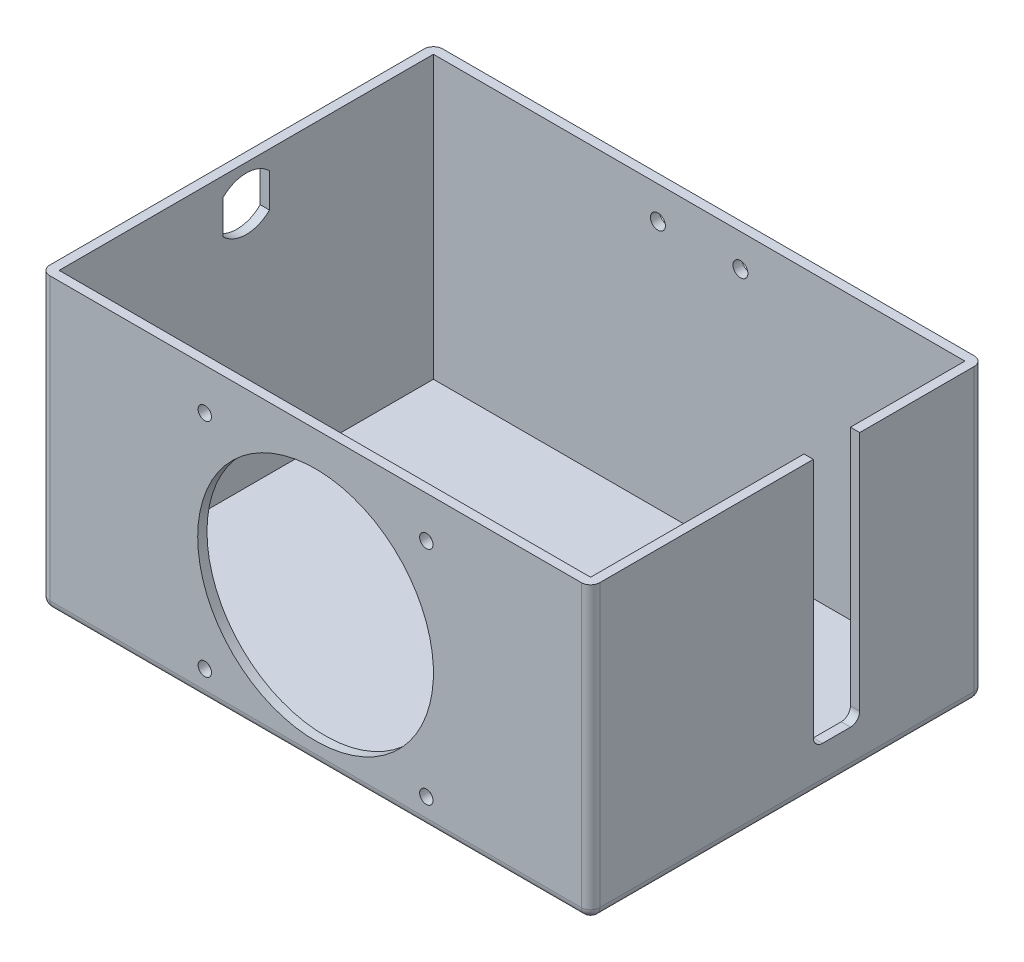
ISO-10303-21;
HEADER;
FILE_DESCRIPTION(('STEP AP214'),'2;1');
FILE_NAME('part.step','',(''),(''),'','','');
FILE_SCHEMA(('AUTOMOTIVE_DESIGN { 1 0 10303 214 1 1 1 1 }'));
ENDSEC;
DATA;
#1=APPLICATION_CONTEXT('core data for automotive mechanical design processes');
#2=APPLICATION_PROTOCOL_DEFINITION('international standard','automotive_design',2000,#1);
#3=PRODUCT_CONTEXT('',#1,'mechanical');
#4=PRODUCT('Part','Part','',(#3));
#5=PRODUCT_RELATED_PRODUCT_CATEGORY('part','',(#4));
#6=PRODUCT_DEFINITION_FORMATION('','',#4);
#7=PRODUCT_DEFINITION_CONTEXT('part definition',#1,'design');
#8=PRODUCT_DEFINITION('design','',#6,#7);
#9=PRODUCT_DEFINITION_SHAPE('','',#8);
#10=(LENGTH_UNIT() NAMED_UNIT(*) SI_UNIT(.MILLI.,.METRE.));
#11=(NAMED_UNIT(*) PLANE_ANGLE_UNIT() SI_UNIT($,.RADIAN.));
#12=(NAMED_UNIT(*) SI_UNIT($,.STERADIAN.) SOLID_ANGLE_UNIT());
#13=UNCERTAINTY_MEASURE_WITH_UNIT(LENGTH_MEASURE(1.E-05),#10,'distance_accuracy_value','');
#14=(GEOMETRIC_REPRESENTATION_CONTEXT(3) GLOBAL_UNCERTAINTY_ASSIGNED_CONTEXT((#13)) GLOBAL_UNIT_ASSIGNED_CONTEXT((#10,
#11,#12)) REPRESENTATION_CONTEXT('',''));
#15=CARTESIAN_POINT('',(0.,0.,0.));
#16=DIRECTION('',(0.,0.,1.));
#17=DIRECTION('',(1.,0.,0.));
#18=AXIS2_PLACEMENT_3D('',#15,#16,#17);
#19=CARTESIAN_POINT('',(88.9,0.,-63.5));
#20=DIRECTION('',(0.,0.,-1.));
#21=DIRECTION('',(-1.,0.,0.));
#22=AXIS2_PLACEMENT_3D('',#19,#20,#21);
#23=PLANE('',#22);
#24=DIRECTION('',(-1.,0.,0.));
#25=VECTOR('',#24,1.);
#26=CARTESIAN_POINT('',(-88.9,3.,-63.5));
#27=LINE('',#26,#25);
#28=CARTESIAN_POINT('',(85.9,3.,-63.5));
#29=VERTEX_POINT('',#28);
#30=CARTESIAN_POINT('',(-85.9,3.,-63.5));
#31=VERTEX_POINT('',#30);
#32=EDGE_CURVE('E405',#29,#31,#27,.T.);
#33=ORIENTED_EDGE('',*,*,#32,.T.);
#34=DIRECTION('',(0.,1.,0.));
#35=VECTOR('',#34,1.);
#36=CARTESIAN_POINT('',(-85.9,0.,-63.5));
#37=LINE('',#36,#35);
#38=CARTESIAN_POINT('',(-85.9,93.98,-63.5));
#39=VERTEX_POINT('',#38);
#40=EDGE_CURVE('E411',#31,#39,#37,.T.);
#41=ORIENTED_EDGE('',*,*,#40,.T.);
#42=DIRECTION('',(-1.,0.,0.));
#43=VECTOR('',#42,1.);
#44=CARTESIAN_POINT('',(88.9,93.98,-63.5));
#45=LINE('',#44,#43);
#46=CARTESIAN_POINT('',(85.9,93.98,-63.5));
#47=VERTEX_POINT('',#46);
#48=EDGE_CURVE('E348',#47,#39,#45,.T.);
#49=ORIENTED_EDGE('',*,*,#48,.F.);
#50=DIRECTION('',(0.,1.,0.));
#51=VECTOR('',#50,1.);
#52=CARTESIAN_POINT('',(85.9,0.,-63.5));
#53=LINE('',#52,#51);
#54=EDGE_CURVE('E408',#47,#29,#53,.F.);
#55=ORIENTED_EDGE('',*,*,#54,.T.);
#56=EDGE_LOOP('',(#33,#41,#49,#55));
#57=FACE_BOUND('',#56,.T.);
#58=CARTESIAN_POINT('',(13.335,83.439,-63.5));
#59=DIRECTION('',(0.,0.,-1.));
#60=DIRECTION('',(-1.,0.,0.));
#61=AXIS2_PLACEMENT_3D('',#58,#59,#60);
#62=CIRCLE('',#61,2.413);
#63=CARTESIAN_POINT('',(10.922,83.439,-63.5));
#64=VERTEX_POINT('',#63);
#65=EDGE_CURVE('E497',#64,#64,#62,.T.);
#66=ORIENTED_EDGE('',*,*,#65,.F.);
#67=EDGE_LOOP('',(#66));
#68=FACE_BOUND('',#67,.T.);
#69=CARTESIAN_POINT('',(-13.335,83.439,-63.5));
#70=DIRECTION('',(0.,0.,1.));
#71=DIRECTION('',(1.,0.,0.));
#72=AXIS2_PLACEMENT_3D('',#69,#70,#71);
#73=CIRCLE('',#72,2.413);
#74=CARTESIAN_POINT('',(-10.922,83.439,-63.5));
#75=VERTEX_POINT('',#74);
#76=EDGE_CURVE('E955',#75,#75,#73,.T.);
#77=ORIENTED_EDGE('',*,*,#76,.T.);
#78=EDGE_LOOP('',(#77));
#79=FACE_BOUND('',#78,.T.);
#80=ADVANCED_FACE('F39',(#57,#68,#79),#23,.T.);
#81=CARTESIAN_POINT('',(85.9,3.,-60.5));
#82=DIRECTION('',(0.,0.,-1.));
#83=DIRECTION('',(-1.,0.,0.));
#84=AXIS2_PLACEMENT_3D('',#81,#82,#83);
#85=PLANE('',#84);
#86=CARTESIAN_POINT('',(13.335,83.439,-60.5));
#87=DIRECTION('',(0.,0.,-1.));
#88=DIRECTION('',(-1.,0.,0.));
#89=AXIS2_PLACEMENT_3D('',#86,#87,#88);
#90=CIRCLE('',#89,2.413);
#91=CARTESIAN_POINT('',(10.922,83.439,-60.5));
#92=VERTEX_POINT('',#91);
#93=EDGE_CURVE('E963',#92,#92,#90,.F.);
#94=ORIENTED_EDGE('',*,*,#93,.F.);
#95=EDGE_LOOP('',(#94));
#96=FACE_BOUND('',#95,.T.);
#97=DIRECTION('',(-1.,0.,0.));
#98=VECTOR('',#97,1.);
#99=CARTESIAN_POINT('',(85.9,93.98,-60.5));
#100=LINE('',#99,#98);
#101=CARTESIAN_POINT('',(85.9,93.98,-60.5));
#102=VERTEX_POINT('',#101);
#103=CARTESIAN_POINT('',(-85.9,93.98,-60.5));
#104=VERTEX_POINT('',#103);
#105=EDGE_CURVE('E295',#102,#104,#100,.T.);
#106=ORIENTED_EDGE('',*,*,#105,.T.);
#107=DIRECTION('',(0.,1.,0.));
#108=VECTOR('',#107,1.);
#109=CARTESIAN_POINT('',(-85.9,3.,-60.5));
#110=LINE('',#109,#108);
#111=CARTESIAN_POINT('',(-85.9,3.,-60.5));
#112=VERTEX_POINT('',#111);
#113=EDGE_CURVE('E322',#112,#104,#110,.T.);
#114=ORIENTED_EDGE('',*,*,#113,.F.);
#115=DIRECTION('',(-1.,0.,0.));
#116=VECTOR('',#115,1.);
#117=CARTESIAN_POINT('',(85.9,3.,-60.5));
#118=LINE('',#117,#116);
#119=CARTESIAN_POINT('',(85.9,3.,-60.5));
#120=VERTEX_POINT('',#119);
#121=EDGE_CURVE('E303',#120,#112,#118,.T.);
#122=ORIENTED_EDGE('',*,*,#121,.F.);
#123=DIRECTION('',(0.,1.,0.));
#124=VECTOR('',#123,1.);
#125=CARTESIAN_POINT('',(85.9,3.,-60.5));
#126=LINE('',#125,#124);
#127=EDGE_CURVE('E326',#120,#102,#126,.T.);
#128=ORIENTED_EDGE('',*,*,#127,.T.);
#129=EDGE_LOOP('',(#106,#114,#122,#128));
#130=FACE_BOUND('',#129,.T.);
#131=CARTESIAN_POINT('',(-13.335,83.439,-60.5));
#132=DIRECTION('',(0.,0.,-1.));
#133=DIRECTION('',(-1.,0.,0.));
#134=AXIS2_PLACEMENT_3D('',#131,#132,#133);
#135=CIRCLE('',#134,2.413);
#136=CARTESIAN_POINT('',(-15.748,83.439,-60.5));
#137=VERTEX_POINT('',#136);
#138=EDGE_CURVE('E439',#137,#137,#135,.T.);
#139=ORIENTED_EDGE('',*,*,#138,.T.);
#140=EDGE_LOOP('',(#139));
#141=FACE_BOUND('',#140,.T.);
#142=ADVANCED_FACE('F549',(#96,#130,#141),#85,.F.);
#143=CARTESIAN_POINT('',(-85.9,3.,60.5));
#144=DIRECTION('',(0.,0.,1.));
#145=DIRECTION('',(1.,0.,0.));
#146=AXIS2_PLACEMENT_3D('',#143,#144,#145);
#147=PLANE('',#146);
#148=CARTESIAN_POINT('',(-35.809,80.604,60.5));
#149=DIRECTION('',(0.,0.,-1.));
#150=DIRECTION('',(-1.,0.,0.));
#151=AXIS2_PLACEMENT_3D('',#148,#149,#150);
#152=CIRCLE('',#151,2.15899999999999);
#153=CARTESIAN_POINT('',(-37.968,80.604,60.5));
#154=VERTEX_POINT('',#153);
#155=EDGE_CURVE('E494',#154,#154,#152,.T.);
#156=ORIENTED_EDGE('',*,*,#155,.F.);
#157=EDGE_LOOP('',(#156));
#158=FACE_BOUND('',#157,.T.);
#159=CARTESIAN_POINT('',(35.809,80.604,60.5));
#160=DIRECTION('',(0.,0.,-1.));
#161=DIRECTION('',(-1.,0.,0.));
#162=AXIS2_PLACEMENT_3D('',#159,#160,#161);
#163=CIRCLE('',#162,2.15899999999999);
#164=CARTESIAN_POINT('',(33.65,80.604,60.5));
#165=VERTEX_POINT('',#164);
#166=EDGE_CURVE('E522',#165,#165,#163,.T.);
#167=ORIENTED_EDGE('',*,*,#166,.F.);
#168=EDGE_LOOP('',(#167));
#169=FACE_BOUND('',#168,.T.);
#170=DIRECTION('',(1.,0.,0.));
#171=VECTOR('',#170,1.);
#172=CARTESIAN_POINT('',(-85.9,93.98,60.5));
#173=LINE('',#172,#171);
#174=CARTESIAN_POINT('',(-85.9,93.98,60.5));
#175=VERTEX_POINT('',#174);
#176=CARTESIAN_POINT('',(85.9,93.98,60.5));
#177=VERTEX_POINT('',#176);
#178=EDGE_CURVE('E310',#175,#177,#173,.T.);
#179=ORIENTED_EDGE('',*,*,#178,.T.);
#180=DIRECTION('',(0.,1.,0.));
#181=VECTOR('',#180,1.);
#182=CARTESIAN_POINT('',(85.9,3.,60.5));
#183=LINE('',#182,#181);
#184=CARTESIAN_POINT('',(85.9,3.,60.5));
#185=VERTEX_POINT('',#184);
#186=EDGE_CURVE('E330',#185,#177,#183,.T.);
#187=ORIENTED_EDGE('',*,*,#186,.F.);
#188=DIRECTION('',(1.,0.,0.));
#189=VECTOR('',#188,1.);
#190=CARTESIAN_POINT('',(-85.9,3.,60.5));
#191=LINE('',#190,#189);
#192=CARTESIAN_POINT('',(-85.9,3.,60.5));
#193=VERTEX_POINT('',#192);
#194=EDGE_CURVE('E294',#193,#185,#191,.T.);
#195=ORIENTED_EDGE('',*,*,#194,.F.);
#196=DIRECTION('',(0.,1.,0.));
#197=VECTOR('',#196,1.);
#198=CARTESIAN_POINT('',(-85.9,3.,60.5));
#199=LINE('',#198,#197);
#200=EDGE_CURVE('E307',#193,#175,#199,.T.);
#201=ORIENTED_EDGE('',*,*,#200,.T.);
#202=EDGE_LOOP('',(#179,#187,#195,#201));
#203=FACE_BOUND('',#202,.T.);
#204=CARTESIAN_POINT('',(-35.809,8.986,60.5));
#205=DIRECTION('',(0.,0.,-1.));
#206=DIRECTION('',(-1.,0.,0.));
#207=AXIS2_PLACEMENT_3D('',#204,#205,#206);
#208=CIRCLE('',#207,2.15899999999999);
#209=CARTESIAN_POINT('',(-37.968,8.986,60.5));
#210=VERTEX_POINT('',#209);
#211=EDGE_CURVE('E515',#210,#210,#208,.T.);
#212=ORIENTED_EDGE('',*,*,#211,.F.);
#213=EDGE_LOOP('',(#212));
#214=FACE_BOUND('',#213,.T.);
#215=CARTESIAN_POINT('',(35.809,8.986,60.5));
#216=DIRECTION('',(0.,0.,-1.));
#217=DIRECTION('',(-1.,0.,0.));
#218=AXIS2_PLACEMENT_3D('',#215,#216,#217);
#219=CIRCLE('',#218,2.15899999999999);
#220=CARTESIAN_POINT('',(33.65,8.986,60.5));
#221=VERTEX_POINT('',#220);
#222=EDGE_CURVE('E507',#221,#221,#219,.T.);
#223=ORIENTED_EDGE('',*,*,#222,.F.);
#224=EDGE_LOOP('',(#223));
#225=FACE_BOUND('',#224,.T.);
#226=CARTESIAN_POINT('',(0.,44.795,60.5));
#227=DIRECTION('',(0.,0.,-1.));
#228=DIRECTION('',(-1.,0.,0.));
#229=AXIS2_PLACEMENT_3D('',#226,#227,#228);
#230=CIRCLE('',#229,38.1);
#231=CARTESIAN_POINT('',(-38.1,44.795,60.5));
#232=VERTEX_POINT('',#231);
#233=EDGE_CURVE('E482',#232,#232,#230,.T.);
#234=ORIENTED_EDGE('',*,*,#233,.F.);
#235=EDGE_LOOP('',(#234));
#236=FACE_BOUND('',#235,.T.);
#237=ADVANCED_FACE('F555',(#158,#169,#203,#214,#225,#236),#147,.F.);
#238=CARTESIAN_POINT('',(-88.9,0.,-63.5));
#239=DIRECTION('',(-1.,0.,0.));
#240=DIRECTION('',(0.,0.,1.));
#241=AXIS2_PLACEMENT_3D('',#238,#239,#240);
#242=PLANE('',#241);
#243=CARTESIAN_POINT('',(-88.9,84.3733981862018,0.));
#244=DIRECTION('',(1.,0.,0.));
#245=DIRECTION('',(0.,0.,-1.));
#246=AXIS2_PLACEMENT_3D('',#243,#244,#245);
#247=CIRCLE('',#246,10.6066017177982);
#248=CARTESIAN_POINT('',(-88.9,76.8733981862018,7.5));
#249=VERTEX_POINT('',#248);
#250=CARTESIAN_POINT('',(-88.9,76.8733981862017,-7.5));
#251=VERTEX_POINT('',#250);
#252=EDGE_CURVE('E207',#249,#251,#247,.T.);
#253=ORIENTED_EDGE('',*,*,#252,.T.);
#254=DIRECTION('',(0.,1.,0.));
#255=VECTOR('',#254,1.);
#256=CARTESIAN_POINT('',(-88.9,76.8733981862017,-7.5));
#257=LINE('',#256,#255);
#258=CARTESIAN_POINT('',(-88.9,87.8733981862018,-7.5));
#259=VERTEX_POINT('',#258);
#260=EDGE_CURVE('E220',#251,#259,#257,.T.);
#261=ORIENTED_EDGE('',*,*,#260,.T.);
#262=CARTESIAN_POINT('',(-88.9,80.3733981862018,0.));
#263=DIRECTION('',(1.,0.,0.));
#264=DIRECTION('',(0.,0.,-1.));
#265=AXIS2_PLACEMENT_3D('',#262,#263,#264);
#266=CIRCLE('',#265,10.6066017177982);
#267=CARTESIAN_POINT('',(-88.9,87.8733981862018,7.5));
#268=VERTEX_POINT('',#267);
#269=EDGE_CURVE('E225',#259,#268,#266,.T.);
#270=ORIENTED_EDGE('',*,*,#269,.T.);
#271=DIRECTION('',(0.,-1.,0.));
#272=VECTOR('',#271,1.);
#273=CARTESIAN_POINT('',(-88.9,87.8733981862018,7.5));
#274=LINE('',#273,#272);
#275=EDGE_CURVE('E216',#268,#249,#274,.T.);
#276=ORIENTED_EDGE('',*,*,#275,.T.);
#277=EDGE_LOOP('',(#253,#261,#270,#276));
#278=FACE_BOUND('',#277,.T.);
#279=DIRECTION('',(0.,0.,1.));
#280=VECTOR('',#279,1.);
#281=CARTESIAN_POINT('',(-88.9,3.,63.5));
#282=LINE('',#281,#280);
#283=CARTESIAN_POINT('',(-88.9,3.,-60.5));
#284=VERTEX_POINT('',#283);
#285=CARTESIAN_POINT('',(-88.9,3.,60.5));
#286=VERTEX_POINT('',#285);
#287=EDGE_CURVE('E383',#284,#286,#282,.T.);
#288=ORIENTED_EDGE('',*,*,#287,.T.);
#289=DIRECTION('',(0.,1.,0.));
#290=VECTOR('',#289,1.);
#291=CARTESIAN_POINT('',(-88.9,0.,60.5));
#292=LINE('',#291,#290);
#293=CARTESIAN_POINT('',(-88.9,93.98,60.5));
#294=VERTEX_POINT('',#293);
#295=EDGE_CURVE('E389',#286,#294,#292,.T.);
#296=ORIENTED_EDGE('',*,*,#295,.T.);
#297=DIRECTION('',(0.,0.,1.));
#298=VECTOR('',#297,1.);
#299=CARTESIAN_POINT('',(-88.9,93.98,-63.5));
#300=LINE('',#299,#298);
#301=CARTESIAN_POINT('',(-88.9,93.98,-60.5));
#302=VERTEX_POINT('',#301);
#303=EDGE_CURVE('E325',#302,#294,#300,.T.);
#304=ORIENTED_EDGE('',*,*,#303,.F.);
#305=DIRECTION('',(0.,1.,0.));
#306=VECTOR('',#305,1.);
#307=CARTESIAN_POINT('',(-88.9,0.,-60.5));
#308=LINE('',#307,#306);
#309=EDGE_CURVE('E386',#302,#284,#308,.F.);
#310=ORIENTED_EDGE('',*,*,#309,.T.);
#311=EDGE_LOOP('',(#288,#296,#304,#310));
#312=FACE_BOUND('',#311,.T.);
#313=ADVANCED_FACE('F227',(#278,#312),#242,.T.);
#314=CARTESIAN_POINT('',(88.9,0.,63.5));
#315=DIRECTION('',(1.,0.,0.));
#316=DIRECTION('',(0.,0.,-1.));
#317=AXIS2_PLACEMENT_3D('',#314,#315,#316);
#318=PLANE('',#317);
#319=DIRECTION('',(0.,0.,-1.));
#320=VECTOR('',#319,1.);
#321=CARTESIAN_POINT('',(88.9,93.98,63.5));
#322=LINE('',#321,#320);
#323=CARTESIAN_POINT('',(88.9,93.98,60.5));
#324=VERTEX_POINT('',#323);
#325=CARTESIAN_POINT('',(88.9,93.98,-8.5));
#326=VERTEX_POINT('',#325);
#327=EDGE_CURVE('E344',#324,#326,#322,.T.);
#328=ORIENTED_EDGE('',*,*,#327,.F.);
#329=DIRECTION('',(0.,1.,0.));
#330=VECTOR('',#329,1.);
#331=CARTESIAN_POINT('',(88.9,0.,60.5));
#332=LINE('',#331,#330);
#333=CARTESIAN_POINT('',(88.9,3.,60.5));
#334=VERTEX_POINT('',#333);
#335=EDGE_CURVE('E380',#324,#334,#332,.F.);
#336=ORIENTED_EDGE('',*,*,#335,.T.);
#337=DIRECTION('',(0.,0.,-1.));
#338=VECTOR('',#337,1.);
#339=CARTESIAN_POINT('',(88.9,3.,-63.5));
#340=LINE('',#339,#338);
#341=CARTESIAN_POINT('',(88.9,3.,-60.5));
#342=VERTEX_POINT('',#341);
#343=EDGE_CURVE('E377',#334,#342,#340,.T.);
#344=ORIENTED_EDGE('',*,*,#343,.T.);
#345=DIRECTION('',(0.,1.,0.));
#346=VECTOR('',#345,1.);
#347=CARTESIAN_POINT('',(88.9,0.,-60.5));
#348=LINE('',#347,#346);
#349=CARTESIAN_POINT('',(88.9,93.98,-60.5));
#350=VERTEX_POINT('',#349);
#351=EDGE_CURVE('E374',#342,#350,#348,.T.);
#352=ORIENTED_EDGE('',*,*,#351,.T.);
#353=CARTESIAN_POINT('',(88.9,93.98,-23.5));
#354=VERTEX_POINT('',#353);
#355=EDGE_CURVE('E343',#354,#350,#322,.T.);
#356=ORIENTED_EDGE('',*,*,#355,.F.);
#357=DIRECTION('',(0.,-1.,0.));
#358=VECTOR('',#357,1.);
#359=CARTESIAN_POINT('',(88.9,93.98,-23.5));
#360=LINE('',#359,#358);
#361=CARTESIAN_POINT('',(88.9,16.,-23.5));
#362=VERTEX_POINT('',#361);
#363=EDGE_CURVE('E262',#354,#362,#360,.T.);
#364=ORIENTED_EDGE('',*,*,#363,.T.);
#365=CARTESIAN_POINT('',(88.9,16.,-20.5));
#366=DIRECTION('',(1.,0.,0.));
#367=DIRECTION('',(0.,0.,-1.));
#368=AXIS2_PLACEMENT_3D('',#365,#366,#367);
#369=CIRCLE('',#368,3.);
#370=CARTESIAN_POINT('',(88.9,13.,-20.5));
#371=VERTEX_POINT('',#370);
#372=EDGE_CURVE('E429',#362,#371,#369,.F.);
#373=ORIENTED_EDGE('',*,*,#372,.T.);
#374=DIRECTION('',(0.,0.,1.));
#375=VECTOR('',#374,1.);
#376=CARTESIAN_POINT('',(88.9,13.,-23.5));
#377=LINE('',#376,#375);
#378=CARTESIAN_POINT('',(88.9,13.,-11.5));
#379=VERTEX_POINT('',#378);
#380=EDGE_CURVE('E266',#371,#379,#377,.T.);
#381=ORIENTED_EDGE('',*,*,#380,.T.);
#382=CARTESIAN_POINT('',(88.9,16.,-11.5));
#383=DIRECTION('',(1.,0.,0.));
#384=DIRECTION('',(0.,0.,-1.));
#385=AXIS2_PLACEMENT_3D('',#382,#383,#384);
#386=CIRCLE('',#385,3.);
#387=CARTESIAN_POINT('',(88.9,16.,-8.50000000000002));
#388=VERTEX_POINT('',#387);
#389=EDGE_CURVE('E11',#379,#388,#386,.F.);
#390=ORIENTED_EDGE('',*,*,#389,.T.);
#391=DIRECTION('',(0.,1.,0.));
#392=VECTOR('',#391,1.);
#393=CARTESIAN_POINT('',(88.9,13.,-8.50000000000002));
#394=LINE('',#393,#392);
#395=EDGE_CURVE('E271',#388,#326,#394,.T.);
#396=ORIENTED_EDGE('',*,*,#395,.T.);
#397=EDGE_LOOP('',(#328,#336,#344,#352,#356,#364,#373,#381,#390,#396));
#398=FACE_BOUND('',#397,.T.);
#399=ADVANCED_FACE('F563',(#398),#318,.T.);
#400=CARTESIAN_POINT('',(-88.9,0.,63.5));
#401=DIRECTION('',(0.,0.,1.));
#402=DIRECTION('',(1.,0.,0.));
#403=AXIS2_PLACEMENT_3D('',#400,#401,#402);
#404=PLANE('',#403);
#405=CARTESIAN_POINT('',(0.,44.795,63.5));
#406=DIRECTION('',(0.,0.,-1.));
#407=DIRECTION('',(-1.,0.,0.));
#408=AXIS2_PLACEMENT_3D('',#405,#406,#407);
#409=CIRCLE('',#408,38.1);
#410=CARTESIAN_POINT('',(-38.1,44.795,63.5));
#411=VERTEX_POINT('',#410);
#412=EDGE_CURVE('E488',#411,#411,#409,.T.);
#413=ORIENTED_EDGE('',*,*,#412,.T.);
#414=EDGE_LOOP('',(#413));
#415=FACE_BOUND('',#414,.T.);
#416=CARTESIAN_POINT('',(-35.809,80.604,63.5));
#417=DIRECTION('',(0.,0.,-1.));
#418=DIRECTION('',(-1.,0.,0.));
#419=AXIS2_PLACEMENT_3D('',#416,#417,#418);
#420=CIRCLE('',#419,2.15899999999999);
#421=CARTESIAN_POINT('',(-37.968,80.604,63.5));
#422=VERTEX_POINT('',#421);
#423=EDGE_CURVE('E503',#422,#422,#420,.T.);
#424=ORIENTED_EDGE('',*,*,#423,.T.);
#425=EDGE_LOOP('',(#424));
#426=FACE_BOUND('',#425,.T.);
#427=CARTESIAN_POINT('',(35.809,8.986,63.5));
#428=DIRECTION('',(0.,0.,-1.));
#429=DIRECTION('',(-1.,0.,0.));
#430=AXIS2_PLACEMENT_3D('',#427,#428,#429);
#431=CIRCLE('',#430,2.15899999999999);
#432=CARTESIAN_POINT('',(33.65,8.986,63.5));
#433=VERTEX_POINT('',#432);
#434=EDGE_CURVE('E511',#433,#433,#431,.T.);
#435=ORIENTED_EDGE('',*,*,#434,.T.);
#436=EDGE_LOOP('',(#435));
#437=FACE_BOUND('',#436,.T.);
#438=CARTESIAN_POINT('',(-35.809,8.986,63.5));
#439=DIRECTION('',(0.,0.,-1.));
#440=DIRECTION('',(-1.,0.,0.));
#441=AXIS2_PLACEMENT_3D('',#438,#439,#440);
#442=CIRCLE('',#441,2.15899999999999);
#443=CARTESIAN_POINT('',(-37.968,8.986,63.5));
#444=VERTEX_POINT('',#443);
#445=EDGE_CURVE('E519',#444,#444,#442,.T.);
#446=ORIENTED_EDGE('',*,*,#445,.T.);
#447=EDGE_LOOP('',(#446));
#448=FACE_BOUND('',#447,.T.);
#449=CARTESIAN_POINT('',(35.809,80.604,63.5));
#450=DIRECTION('',(0.,0.,-1.));
#451=DIRECTION('',(-1.,0.,0.));
#452=AXIS2_PLACEMENT_3D('',#449,#450,#451);
#453=CIRCLE('',#452,2.15899999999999);
#454=CARTESIAN_POINT('',(33.65,80.604,63.5));
#455=VERTEX_POINT('',#454);
#456=EDGE_CURVE('E238',#455,#455,#453,.T.);
#457=ORIENTED_EDGE('',*,*,#456,.T.);
#458=EDGE_LOOP('',(#457));
#459=FACE_BOUND('',#458,.T.);
#460=DIRECTION('',(1.,0.,0.));
#461=VECTOR('',#460,1.);
#462=CARTESIAN_POINT('',(88.9,3.,63.5));
#463=LINE('',#462,#461);
#464=CARTESIAN_POINT('',(-85.9,3.,63.5));
#465=VERTEX_POINT('',#464);
#466=CARTESIAN_POINT('',(85.9,3.,63.5));
#467=VERTEX_POINT('',#466);
#468=EDGE_CURVE('E352',#465,#467,#463,.T.);
#469=ORIENTED_EDGE('',*,*,#468,.T.);
#470=DIRECTION('',(0.,1.,0.));
#471=VECTOR('',#470,1.);
#472=CARTESIAN_POINT('',(85.9,0.,63.5));
#473=LINE('',#472,#471);
#474=CARTESIAN_POINT('',(85.9,93.98,63.5));
#475=VERTEX_POINT('',#474);
#476=EDGE_CURVE('E358',#467,#475,#473,.T.);
#477=ORIENTED_EDGE('',*,*,#476,.T.);
#478=DIRECTION('',(1.,0.,0.));
#479=VECTOR('',#478,1.);
#480=CARTESIAN_POINT('',(-88.9,93.98,63.5));
#481=LINE('',#480,#479);
#482=CARTESIAN_POINT('',(-85.9,93.98,63.5));
#483=VERTEX_POINT('',#482);
#484=EDGE_CURVE('E339',#483,#475,#481,.T.);
#485=ORIENTED_EDGE('',*,*,#484,.F.);
#486=DIRECTION('',(0.,1.,0.));
#487=VECTOR('',#486,1.);
#488=CARTESIAN_POINT('',(-85.9,0.,63.5));
#489=LINE('',#488,#487);
#490=EDGE_CURVE('E355',#483,#465,#489,.F.);
#491=ORIENTED_EDGE('',*,*,#490,.T.);
#492=EDGE_LOOP('',(#469,#477,#485,#491));
#493=FACE_BOUND('',#492,.T.);
#494=ADVANCED_FACE('F531',(#415,#426,#437,#448,#459,#493),#404,.T.);
#495=CARTESIAN_POINT('',(0.,0.,0.));
#496=DIRECTION('',(0.,1.,0.));
#497=DIRECTION('',(0.,0.,1.));
#498=AXIS2_PLACEMENT_3D('',#495,#496,#497);
#499=PLANE('',#498);
#500=DIRECTION('',(0.,0.,-1.));
#501=VECTOR('',#500,1.);
#502=CARTESIAN_POINT('',(85.9,0.,63.5));
#503=LINE('',#502,#501);
#504=CARTESIAN_POINT('',(85.9,0.,-60.5));
#505=VERTEX_POINT('',#504);
#506=CARTESIAN_POINT('',(85.9,0.,60.5));
#507=VERTEX_POINT('',#506);
#508=EDGE_CURVE('E398',#505,#507,#503,.F.);
#509=ORIENTED_EDGE('',*,*,#508,.T.);
#510=DIRECTION('',(1.,0.,0.));
#511=VECTOR('',#510,1.);
#512=CARTESIAN_POINT('',(-88.9,0.,60.5));
#513=LINE('',#512,#511);
#514=CARTESIAN_POINT('',(-85.9,0.,60.5));
#515=VERTEX_POINT('',#514);
#516=EDGE_CURVE('E401',#507,#515,#513,.F.);
#517=ORIENTED_EDGE('',*,*,#516,.T.);
#518=DIRECTION('',(0.,0.,1.));
#519=VECTOR('',#518,1.);
#520=CARTESIAN_POINT('',(-85.9,0.,-63.5));
#521=LINE('',#520,#519);
#522=CARTESIAN_POINT('',(-85.9,0.,-60.5));
#523=VERTEX_POINT('',#522);
#524=EDGE_CURVE('E395',#515,#523,#521,.F.);
#525=ORIENTED_EDGE('',*,*,#524,.T.);
#526=DIRECTION('',(-1.,0.,0.));
#527=VECTOR('',#526,1.);
#528=CARTESIAN_POINT('',(88.9,0.,-60.5));
#529=LINE('',#528,#527);
#530=EDGE_CURVE('E392',#523,#505,#529,.F.);
#531=ORIENTED_EDGE('',*,*,#530,.T.);
#532=EDGE_LOOP('',(#509,#517,#525,#531));
#533=FACE_BOUND('',#532,.T.);
#534=ADVANCED_FACE('F569',(#533),#499,.F.);
#535=CARTESIAN_POINT('',(0.,93.98,0.));
#536=DIRECTION('',(0.,1.,0.));
#537=DIRECTION('',(0.,0.,1.));
#538=AXIS2_PLACEMENT_3D('',#535,#536,#537);
#539=PLANE('',#538);
#540=ORIENTED_EDGE('',*,*,#484,.T.);
#541=CARTESIAN_POINT('',(85.9,93.98,60.5));
#542=DIRECTION('',(0.,1.,0.));
#543=DIRECTION('',(0.,0.,1.));
#544=AXIS2_PLACEMENT_3D('',#541,#542,#543);
#545=CIRCLE('',#544,3.);
#546=EDGE_CURVE('E371',#475,#324,#545,.T.);
#547=ORIENTED_EDGE('',*,*,#546,.T.);
#548=ORIENTED_EDGE('',*,*,#327,.T.);
#549=DIRECTION('',(-1.,0.,0.));
#550=VECTOR('',#549,1.);
#551=CARTESIAN_POINT('',(88.9,93.98,-8.5));
#552=LINE('',#551,#550);
#553=CARTESIAN_POINT('',(85.9,93.98,-8.5));
#554=VERTEX_POINT('',#553);
#555=EDGE_CURVE('E283',#326,#554,#552,.T.);
#556=ORIENTED_EDGE('',*,*,#555,.T.);
#557=DIRECTION('',(0.,0.,-1.));
#558=VECTOR('',#557,1.);
#559=CARTESIAN_POINT('',(85.9,93.98,60.5));
#560=LINE('',#559,#558);
#561=EDGE_CURVE('E315',#177,#554,#560,.T.);
#562=ORIENTED_EDGE('',*,*,#561,.F.);
#563=ORIENTED_EDGE('',*,*,#178,.F.);
#564=DIRECTION('',(0.,0.,1.));
#565=VECTOR('',#564,1.);
#566=CARTESIAN_POINT('',(-85.9,93.98,-60.5));
#567=LINE('',#566,#565);
#568=EDGE_CURVE('E287',#104,#175,#567,.T.);
#569=ORIENTED_EDGE('',*,*,#568,.F.);
#570=ORIENTED_EDGE('',*,*,#105,.F.);
#571=CARTESIAN_POINT('',(85.9,93.98,-23.5));
#572=VERTEX_POINT('',#571);
#573=EDGE_CURVE('E314',#572,#102,#560,.T.);
#574=ORIENTED_EDGE('',*,*,#573,.F.);
#575=DIRECTION('',(-1.,0.,0.));
#576=VECTOR('',#575,1.);
#577=CARTESIAN_POINT('',(88.9,93.98,-23.5));
#578=LINE('',#577,#576);
#579=EDGE_CURVE('E274',#354,#572,#578,.T.);
#580=ORIENTED_EDGE('',*,*,#579,.F.);
#581=ORIENTED_EDGE('',*,*,#355,.T.);
#582=CARTESIAN_POINT('',(85.9,93.98,-60.5));
#583=DIRECTION('',(0.,1.,0.));
#584=DIRECTION('',(0.,0.,1.));
#585=AXIS2_PLACEMENT_3D('',#582,#583,#584);
#586=CIRCLE('',#585,3.);
#587=EDGE_CURVE('E362',#350,#47,#586,.T.);
#588=ORIENTED_EDGE('',*,*,#587,.T.);
#589=ORIENTED_EDGE('',*,*,#48,.T.);
#590=CARTESIAN_POINT('',(-85.9,93.98,-60.5));
#591=DIRECTION('',(0.,1.,0.));
#592=DIRECTION('',(0.,0.,1.));
#593=AXIS2_PLACEMENT_3D('',#590,#591,#592);
#594=CIRCLE('',#593,3.);
#595=EDGE_CURVE('E365',#39,#302,#594,.T.);
#596=ORIENTED_EDGE('',*,*,#595,.T.);
#597=ORIENTED_EDGE('',*,*,#303,.T.);
#598=CARTESIAN_POINT('',(-85.9,93.98,60.5));
#599=DIRECTION('',(0.,1.,0.));
#600=DIRECTION('',(0.,0.,1.));
#601=AXIS2_PLACEMENT_3D('',#598,#599,#600);
#602=CIRCLE('',#601,3.);
#603=EDGE_CURVE('E368',#294,#483,#602,.T.);
#604=ORIENTED_EDGE('',*,*,#603,.T.);
#605=EDGE_LOOP('',(#540,#547,#548,#556,#562,#563,#569,#570,#574,#580,#581,#588,#589,#596,#597,#604));
#606=FACE_BOUND('',#605,.T.);
#607=ADVANCED_FACE('F561',(#606),#539,.T.);
#608=CARTESIAN_POINT('',(-85.9,3.,-60.5));
#609=DIRECTION('',(-1.,0.,0.));
#610=DIRECTION('',(0.,0.,1.));
#611=AXIS2_PLACEMENT_3D('',#608,#609,#610);
#612=PLANE('',#611);
#613=DIRECTION('',(0.,1.,0.));
#614=VECTOR('',#613,1.);
#615=CARTESIAN_POINT('',(-85.9,76.8733981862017,-7.5));
#616=LINE('',#615,#614);
#617=CARTESIAN_POINT('',(-85.9,76.8733981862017,-7.5));
#618=VERTEX_POINT('',#617);
#619=CARTESIAN_POINT('',(-85.9,87.8733981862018,-7.50000000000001));
#620=VERTEX_POINT('',#619);
#621=EDGE_CURVE('E247',#618,#620,#616,.T.);
#622=ORIENTED_EDGE('',*,*,#621,.F.);
#623=CARTESIAN_POINT('',(-85.9,84.3733981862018,0.));
#624=DIRECTION('',(1.,0.,0.));
#625=DIRECTION('',(0.,0.,-1.));
#626=AXIS2_PLACEMENT_3D('',#623,#624,#625);
#627=CIRCLE('',#626,10.6066017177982);
#628=CARTESIAN_POINT('',(-85.9,76.8733981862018,7.5));
#629=VERTEX_POINT('',#628);
#630=EDGE_CURVE('E210',#629,#618,#627,.T.);
#631=ORIENTED_EDGE('',*,*,#630,.F.);
#632=DIRECTION('',(0.,-1.,0.));
#633=VECTOR('',#632,1.);
#634=CARTESIAN_POINT('',(-85.9,87.8733981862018,7.5));
#635=LINE('',#634,#633);
#636=CARTESIAN_POINT('',(-85.9,87.8733981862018,7.5));
#637=VERTEX_POINT('',#636);
#638=EDGE_CURVE('E231',#637,#629,#635,.T.);
#639=ORIENTED_EDGE('',*,*,#638,.F.);
#640=CARTESIAN_POINT('',(-85.9,80.3733981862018,0.));
#641=DIRECTION('',(1.,0.,0.));
#642=DIRECTION('',(0.,0.,-1.));
#643=AXIS2_PLACEMENT_3D('',#640,#641,#642);
#644=CIRCLE('',#643,10.6066017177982);
#645=EDGE_CURVE('E235',#620,#637,#644,.T.);
#646=ORIENTED_EDGE('',*,*,#645,.F.);
#647=EDGE_LOOP('',(#622,#631,#639,#646));
#648=FACE_BOUND('',#647,.T.);
#649=ORIENTED_EDGE('',*,*,#568,.T.);
#650=ORIENTED_EDGE('',*,*,#200,.F.);
#651=DIRECTION('',(0.,0.,1.));
#652=VECTOR('',#651,1.);
#653=CARTESIAN_POINT('',(-85.9,3.,-60.5));
#654=LINE('',#653,#652);
#655=EDGE_CURVE('E290',#112,#193,#654,.T.);
#656=ORIENTED_EDGE('',*,*,#655,.F.);
#657=ORIENTED_EDGE('',*,*,#113,.T.);
#658=EDGE_LOOP('',(#649,#650,#656,#657));
#659=FACE_BOUND('',#658,.T.);
#660=ADVANCED_FACE('F652',(#648,#659),#612,.F.);
#661=CARTESIAN_POINT('',(85.9,3.,60.5));
#662=DIRECTION('',(1.,0.,0.));
#663=DIRECTION('',(0.,0.,-1.));
#664=AXIS2_PLACEMENT_3D('',#661,#662,#663);
#665=PLANE('',#664);
#666=ORIENTED_EDGE('',*,*,#561,.T.);
#667=DIRECTION('',(0.,1.,0.));
#668=VECTOR('',#667,1.);
#669=CARTESIAN_POINT('',(85.9,13.,-8.50000000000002));
#670=LINE('',#669,#668);
#671=CARTESIAN_POINT('',(85.9,16.,-8.50000000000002));
#672=VERTEX_POINT('',#671);
#673=EDGE_CURVE('E267',#672,#554,#670,.T.);
#674=ORIENTED_EDGE('',*,*,#673,.F.);
#675=CARTESIAN_POINT('',(85.9,16.,-11.5));
#676=DIRECTION('',(1.,0.,0.));
#677=DIRECTION('',(0.,0.,-1.));
#678=AXIS2_PLACEMENT_3D('',#675,#676,#677);
#679=CIRCLE('',#678,3.);
#680=CARTESIAN_POINT('',(85.9,13.,-11.5));
#681=VERTEX_POINT('',#680);
#682=EDGE_CURVE('E49',#672,#681,#679,.T.);
#683=ORIENTED_EDGE('',*,*,#682,.T.);
#684=DIRECTION('',(0.,0.,1.));
#685=VECTOR('',#684,1.);
#686=CARTESIAN_POINT('',(85.9,13.,-23.5));
#687=LINE('',#686,#685);
#688=CARTESIAN_POINT('',(85.9,13.,-20.5));
#689=VERTEX_POINT('',#688);
#690=EDGE_CURVE('E277',#689,#681,#687,.T.);
#691=ORIENTED_EDGE('',*,*,#690,.F.);
#692=CARTESIAN_POINT('',(85.9,16.,-20.5));
#693=DIRECTION('',(1.,0.,0.));
#694=DIRECTION('',(0.,0.,-1.));
#695=AXIS2_PLACEMENT_3D('',#692,#693,#694);
#696=CIRCLE('',#695,3.);
#697=CARTESIAN_POINT('',(85.9,16.,-23.5));
#698=VERTEX_POINT('',#697);
#699=EDGE_CURVE('E64',#689,#698,#696,.T.);
#700=ORIENTED_EDGE('',*,*,#699,.T.);
#701=DIRECTION('',(0.,-1.,0.));
#702=VECTOR('',#701,1.);
#703=CARTESIAN_POINT('',(85.9,93.98,-23.5));
#704=LINE('',#703,#702);
#705=EDGE_CURVE('E256',#572,#698,#704,.T.);
#706=ORIENTED_EDGE('',*,*,#705,.F.);
#707=ORIENTED_EDGE('',*,*,#573,.T.);
#708=ORIENTED_EDGE('',*,*,#127,.F.);
#709=DIRECTION('',(0.,0.,-1.));
#710=VECTOR('',#709,1.);
#711=CARTESIAN_POINT('',(85.9,3.,60.5));
#712=LINE('',#711,#710);
#713=EDGE_CURVE('E299',#185,#120,#712,.T.);
#714=ORIENTED_EDGE('',*,*,#713,.F.);
#715=ORIENTED_EDGE('',*,*,#186,.T.);
#716=EDGE_LOOP('',(#666,#674,#683,#691,#700,#706,#707,#708,#714,#715));
#717=FACE_BOUND('',#716,.T.);
#718=ADVANCED_FACE('F643',(#717),#665,.F.);
#719=CARTESIAN_POINT('',(0.,3.,0.));
#720=DIRECTION('',(0.,1.,0.));
#721=DIRECTION('',(0.,0.,1.));
#722=AXIS2_PLACEMENT_3D('',#719,#720,#721);
#723=PLANE('',#722);
#724=ORIENTED_EDGE('',*,*,#655,.T.);
#725=ORIENTED_EDGE('',*,*,#194,.T.);
#726=ORIENTED_EDGE('',*,*,#713,.T.);
#727=ORIENTED_EDGE('',*,*,#121,.T.);
#728=EDGE_LOOP('',(#724,#725,#726,#727));
#729=FACE_BOUND('',#728,.T.);
#730=ADVANCED_FACE('F658',(#729),#723,.T.);
#731=CARTESIAN_POINT('',(88.9,13.,-8.50000000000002));
#732=DIRECTION('',(0.,0.,1.));
#733=DIRECTION('',(0.,-1.,0.));
#734=AXIS2_PLACEMENT_3D('',#731,#732,#733);
#735=PLANE('',#734);
#736=ORIENTED_EDGE('',*,*,#395,.F.);
#737=DIRECTION('',(-1.,0.,0.));
#738=VECTOR('',#737,1.);
#739=CARTESIAN_POINT('',(85.9,16.,-8.50000000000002));
#740=LINE('',#739,#738);
#741=EDGE_CURVE('E424',#388,#672,#740,.T.);
#742=ORIENTED_EDGE('',*,*,#741,.T.);
#743=ORIENTED_EDGE('',*,*,#673,.T.);
#744=ORIENTED_EDGE('',*,*,#555,.F.);
#745=EDGE_LOOP('',(#736,#742,#743,#744));
#746=FACE_BOUND('',#745,.T.);
#747=ADVANCED_FACE('F638',(#746),#735,.F.);
#748=CARTESIAN_POINT('',(88.9,13.,-23.5));
#749=DIRECTION('',(0.,-1.,0.));
#750=DIRECTION('',(0.,0.,-1.));
#751=AXIS2_PLACEMENT_3D('',#748,#749,#750);
#752=PLANE('',#751);
#753=ORIENTED_EDGE('',*,*,#380,.F.);
#754=DIRECTION('',(-1.,0.,0.));
#755=VECTOR('',#754,1.);
#756=CARTESIAN_POINT('',(85.9,13.,-20.5));
#757=LINE('',#756,#755);
#758=EDGE_CURVE('E417',#371,#689,#757,.T.);
#759=ORIENTED_EDGE('',*,*,#758,.T.);
#760=ORIENTED_EDGE('',*,*,#690,.T.);
#761=DIRECTION('',(-1.,0.,0.));
#762=VECTOR('',#761,1.);
#763=CARTESIAN_POINT('',(88.9,13.,-11.5));
#764=LINE('',#763,#762);
#765=EDGE_CURVE('E414',#681,#379,#764,.F.);
#766=ORIENTED_EDGE('',*,*,#765,.T.);
#767=EDGE_LOOP('',(#753,#759,#760,#766));
#768=FACE_BOUND('',#767,.T.);
#769=ADVANCED_FACE('F634',(#768),#752,.F.);
#770=CARTESIAN_POINT('',(88.9,93.98,-23.5));
#771=DIRECTION('',(0.,0.,-1.));
#772=DIRECTION('',(0.,1.,0.));
#773=AXIS2_PLACEMENT_3D('',#770,#771,#772);
#774=PLANE('',#773);
#775=ORIENTED_EDGE('',*,*,#705,.T.);
#776=DIRECTION('',(-1.,0.,0.));
#777=VECTOR('',#776,1.);
#778=CARTESIAN_POINT('',(88.9,16.,-23.5));
#779=LINE('',#778,#777);
#780=EDGE_CURVE('E421',#698,#362,#779,.F.);
#781=ORIENTED_EDGE('',*,*,#780,.T.);
#782=ORIENTED_EDGE('',*,*,#363,.F.);
#783=ORIENTED_EDGE('',*,*,#579,.T.);
#784=EDGE_LOOP('',(#775,#781,#782,#783));
#785=FACE_BOUND('',#784,.T.);
#786=ADVANCED_FACE('F668',(#785),#774,.F.);
#787=CARTESIAN_POINT('',(-88.9,84.3733981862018,0.));
#788=DIRECTION('',(1.,0.,0.));
#789=DIRECTION('',(0.,0.,-1.));
#790=AXIS2_PLACEMENT_3D('',#787,#788,#789);
#791=CYLINDRICAL_SURFACE('',#790,10.6066017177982);
#792=ORIENTED_EDGE('',*,*,#630,.T.);
#793=DIRECTION('',(1.,0.,0.));
#794=VECTOR('',#793,1.);
#795=CARTESIAN_POINT('',(-88.9,76.8733981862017,-7.5));
#796=LINE('',#795,#794);
#797=EDGE_CURVE('E203',#251,#618,#796,.T.);
#798=ORIENTED_EDGE('',*,*,#797,.F.);
#799=ORIENTED_EDGE('',*,*,#252,.F.);
#800=DIRECTION('',(1.,0.,0.));
#801=VECTOR('',#800,1.);
#802=CARTESIAN_POINT('',(-88.9,76.8733981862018,7.5));
#803=LINE('',#802,#801);
#804=EDGE_CURVE('E253',#249,#629,#803,.T.);
#805=ORIENTED_EDGE('',*,*,#804,.T.);
#806=EDGE_LOOP('',(#792,#798,#799,#805));
#807=FACE_BOUND('',#806,.T.);
#808=ADVANCED_FACE('F205',(#807),#791,.F.);
#809=CARTESIAN_POINT('',(-88.9,87.8733981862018,7.5));
#810=DIRECTION('',(0.,0.,1.));
#811=DIRECTION('',(1.,0.,0.));
#812=AXIS2_PLACEMENT_3D('',#809,#810,#811);
#813=PLANE('',#812);
#814=ORIENTED_EDGE('',*,*,#638,.T.);
#815=ORIENTED_EDGE('',*,*,#804,.F.);
#816=ORIENTED_EDGE('',*,*,#275,.F.);
#817=DIRECTION('',(1.,0.,0.));
#818=VECTOR('',#817,1.);
#819=CARTESIAN_POINT('',(-88.9,87.8733981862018,7.5));
#820=LINE('',#819,#818);
#821=EDGE_CURVE('E257',#268,#637,#820,.T.);
#822=ORIENTED_EDGE('',*,*,#821,.T.);
#823=EDGE_LOOP('',(#814,#815,#816,#822));
#824=FACE_BOUND('',#823,.T.);
#825=ADVANCED_FACE('F717',(#824),#813,.F.);
#826=CARTESIAN_POINT('',(-88.9,80.3733981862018,0.));
#827=DIRECTION('',(1.,0.,0.));
#828=DIRECTION('',(0.,0.,-1.));
#829=AXIS2_PLACEMENT_3D('',#826,#827,#828);
#830=CYLINDRICAL_SURFACE('',#829,10.6066017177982);
#831=ORIENTED_EDGE('',*,*,#645,.T.);
#832=ORIENTED_EDGE('',*,*,#821,.F.);
#833=ORIENTED_EDGE('',*,*,#269,.F.);
#834=DIRECTION('',(1.,0.,0.));
#835=VECTOR('',#834,1.);
#836=CARTESIAN_POINT('',(-88.9,87.8733981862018,-7.50000000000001));
#837=LINE('',#836,#835);
#838=EDGE_CURVE('E215',#259,#620,#837,.T.);
#839=ORIENTED_EDGE('',*,*,#838,.T.);
#840=EDGE_LOOP('',(#831,#832,#833,#839));
#841=FACE_BOUND('',#840,.T.);
#842=ADVANCED_FACE('F545',(#841),#830,.F.);
#843=CARTESIAN_POINT('',(-88.9,76.8733981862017,-7.5));
#844=DIRECTION('',(0.,0.,-1.));
#845=DIRECTION('',(-1.,0.,0.));
#846=AXIS2_PLACEMENT_3D('',#843,#844,#845);
#847=PLANE('',#846);
#848=ORIENTED_EDGE('',*,*,#621,.T.);
#849=ORIENTED_EDGE('',*,*,#838,.F.);
#850=ORIENTED_EDGE('',*,*,#260,.F.);
#851=ORIENTED_EDGE('',*,*,#797,.T.);
#852=EDGE_LOOP('',(#848,#849,#850,#851));
#853=FACE_BOUND('',#852,.T.);
#854=ADVANCED_FACE('F221',(#853),#847,.F.);
#855=CARTESIAN_POINT('',(35.809,80.604,60.5));
#856=DIRECTION('',(0.,0.,-1.));
#857=DIRECTION('',(-1.,0.,0.));
#858=AXIS2_PLACEMENT_3D('',#855,#856,#857);
#859=CYLINDRICAL_SURFACE('',#858,2.15899999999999);
#860=ORIENTED_EDGE('',*,*,#456,.F.);
#861=EDGE_LOOP('',(#860));
#862=FACE_BOUND('',#861,.T.);
#863=ORIENTED_EDGE('',*,*,#166,.T.);
#864=EDGE_LOOP('',(#863));
#865=FACE_BOUND('',#864,.T.);
#866=ADVANCED_FACE('F534',(#862,#865),#859,.F.);
#867=CARTESIAN_POINT('',(-35.809,8.986,60.5));
#868=DIRECTION('',(0.,0.,-1.));
#869=DIRECTION('',(-1.,0.,0.));
#870=AXIS2_PLACEMENT_3D('',#867,#868,#869);
#871=CYLINDRICAL_SURFACE('',#870,2.15899999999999);
#872=ORIENTED_EDGE('',*,*,#445,.F.);
#873=EDGE_LOOP('',(#872));
#874=FACE_BOUND('',#873,.T.);
#875=ORIENTED_EDGE('',*,*,#211,.T.);
#876=EDGE_LOOP('',(#875));
#877=FACE_BOUND('',#876,.T.);
#878=ADVANCED_FACE('F536',(#874,#877),#871,.F.);
#879=CARTESIAN_POINT('',(35.809,8.986,60.5));
#880=DIRECTION('',(0.,0.,-1.));
#881=DIRECTION('',(-1.,0.,0.));
#882=AXIS2_PLACEMENT_3D('',#879,#880,#881);
#883=CYLINDRICAL_SURFACE('',#882,2.15899999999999);
#884=ORIENTED_EDGE('',*,*,#434,.F.);
#885=EDGE_LOOP('',(#884));
#886=FACE_BOUND('',#885,.T.);
#887=ORIENTED_EDGE('',*,*,#222,.T.);
#888=EDGE_LOOP('',(#887));
#889=FACE_BOUND('',#888,.T.);
#890=ADVANCED_FACE('F542',(#886,#889),#883,.F.);
#891=CARTESIAN_POINT('',(-35.809,80.604,60.5));
#892=DIRECTION('',(0.,0.,-1.));
#893=DIRECTION('',(-1.,0.,0.));
#894=AXIS2_PLACEMENT_3D('',#891,#892,#893);
#895=CYLINDRICAL_SURFACE('',#894,2.15899999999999);
#896=ORIENTED_EDGE('',*,*,#423,.F.);
#897=EDGE_LOOP('',(#896));
#898=FACE_BOUND('',#897,.T.);
#899=ORIENTED_EDGE('',*,*,#155,.T.);
#900=EDGE_LOOP('',(#899));
#901=FACE_BOUND('',#900,.T.);
#902=ADVANCED_FACE('F759',(#898,#901),#895,.F.);
#903=CARTESIAN_POINT('',(0.,44.795,60.5));
#904=DIRECTION('',(0.,0.,-1.));
#905=DIRECTION('',(-1.,0.,0.));
#906=AXIS2_PLACEMENT_3D('',#903,#904,#905);
#907=CYLINDRICAL_SURFACE('',#906,38.1);
#908=ORIENTED_EDGE('',*,*,#412,.F.);
#909=EDGE_LOOP('',(#908));
#910=FACE_BOUND('',#909,.T.);
#911=ORIENTED_EDGE('',*,*,#233,.T.);
#912=EDGE_LOOP('',(#911));
#913=FACE_BOUND('',#912,.T.);
#914=ADVANCED_FACE('F618',(#910,#913),#907,.F.);
#915=CARTESIAN_POINT('',(-85.9,0.,-60.5));
#916=DIRECTION('',(0.,1.,0.));
#917=DIRECTION('',(0.,0.,1.));
#918=AXIS2_PLACEMENT_3D('',#915,#916,#917);
#919=CYLINDRICAL_SURFACE('',#918,3.);
#920=CARTESIAN_POINT('',(-85.9,3.,-60.5));
#921=DIRECTION('',(0.,-1.,0.));
#922=DIRECTION('',(0.,0.,-1.));
#923=AXIS2_PLACEMENT_3D('',#920,#921,#922);
#924=CIRCLE('',#923,3.);
#925=EDGE_CURVE('E43',#284,#31,#924,.T.);
#926=ORIENTED_EDGE('',*,*,#925,.F.);
#927=ORIENTED_EDGE('',*,*,#309,.F.);
#928=ORIENTED_EDGE('',*,*,#595,.F.);
#929=ORIENTED_EDGE('',*,*,#40,.F.);
#930=EDGE_LOOP('',(#926,#927,#928,#929));
#931=FACE_BOUND('',#930,.T.);
#932=ADVANCED_FACE('F616',(#931),#919,.T.);
#933=CARTESIAN_POINT('',(-85.9,3.,-60.5));
#934=DIRECTION('',(0.,0.,-1.));
#935=DIRECTION('',(-1.,0.,0.));
#936=AXIS2_PLACEMENT_3D('',#933,#934,#935);
#937=SPHERICAL_SURFACE('',#936,3.);
#938=CARTESIAN_POINT('',(-85.9,3.,-60.5));
#939=DIRECTION('',(0.,0.,-1.));
#940=DIRECTION('',(-1.,0.,0.));
#941=AXIS2_PLACEMENT_3D('',#938,#939,#940);
#942=CIRCLE('',#941,3.);
#943=EDGE_CURVE('E470',#284,#523,#942,.F.);
#944=ORIENTED_EDGE('',*,*,#943,.F.);
#945=ORIENTED_EDGE('',*,*,#925,.T.);
#946=CARTESIAN_POINT('',(-85.9,3.,-60.5));
#947=DIRECTION('',(-1.,0.,0.));
#948=DIRECTION('',(0.,-1.,0.));
#949=AXIS2_PLACEMENT_3D('',#946,#947,#948);
#950=CIRCLE('',#949,3.);
#951=EDGE_CURVE('E473',#523,#31,#950,.F.);
#952=ORIENTED_EDGE('',*,*,#951,.F.);
#953=EDGE_LOOP('',(#944,#945,#952));
#954=FACE_BOUND('',#953,.T.);
#955=ADVANCED_FACE('F612',(#954),#937,.T.);
#956=CARTESIAN_POINT('',(85.9,0.,-60.5));
#957=DIRECTION('',(0.,1.,0.));
#958=DIRECTION('',(0.,0.,1.));
#959=AXIS2_PLACEMENT_3D('',#956,#957,#958);
#960=CYLINDRICAL_SURFACE('',#959,3.);
#961=ORIENTED_EDGE('',*,*,#587,.F.);
#962=ORIENTED_EDGE('',*,*,#351,.F.);
#963=CARTESIAN_POINT('',(85.9,3.,-60.5));
#964=DIRECTION('',(0.,-1.,0.));
#965=DIRECTION('',(0.,0.,-1.));
#966=AXIS2_PLACEMENT_3D('',#963,#964,#965);
#967=CIRCLE('',#966,3.);
#968=EDGE_CURVE('E466',#29,#342,#967,.T.);
#969=ORIENTED_EDGE('',*,*,#968,.F.);
#970=ORIENTED_EDGE('',*,*,#54,.F.);
#971=EDGE_LOOP('',(#961,#962,#969,#970));
#972=FACE_BOUND('',#971,.T.);
#973=ADVANCED_FACE('F609',(#972),#960,.T.);
#974=CARTESIAN_POINT('',(88.9,3.,-60.5));
#975=DIRECTION('',(1.,0.,0.));
#976=DIRECTION('',(0.,0.,-1.));
#977=AXIS2_PLACEMENT_3D('',#974,#975,#976);
#978=CYLINDRICAL_SURFACE('',#977,3.);
#979=ORIENTED_EDGE('',*,*,#951,.T.);
#980=ORIENTED_EDGE('',*,*,#32,.F.);
#981=CARTESIAN_POINT('',(85.9,3.,-60.5));
#982=DIRECTION('',(1.,0.,0.));
#983=DIRECTION('',(0.,0.,-1.));
#984=AXIS2_PLACEMENT_3D('',#981,#982,#983);
#985=CIRCLE('',#984,3.);
#986=EDGE_CURVE('E462',#505,#29,#985,.T.);
#987=ORIENTED_EDGE('',*,*,#986,.F.);
#988=ORIENTED_EDGE('',*,*,#530,.F.);
#989=EDGE_LOOP('',(#979,#980,#987,#988));
#990=FACE_BOUND('',#989,.T.);
#991=ADVANCED_FACE('F605',(#990),#978,.T.);
#992=CARTESIAN_POINT('',(-85.9,3.,-63.5));
#993=DIRECTION('',(0.,0.,-1.));
#994=DIRECTION('',(-1.,0.,0.));
#995=AXIS2_PLACEMENT_3D('',#992,#993,#994);
#996=CYLINDRICAL_SURFACE('',#995,3.);
#997=ORIENTED_EDGE('',*,*,#943,.T.);
#998=ORIENTED_EDGE('',*,*,#524,.F.);
#999=CARTESIAN_POINT('',(-85.9,3.,60.5));
#1000=DIRECTION('',(0.,0.,1.));
#1001=DIRECTION('',(1.,0.,0.));
#1002=AXIS2_PLACEMENT_3D('',#999,#1000,#1001);
#1003=CIRCLE('',#1002,3.);
#1004=EDGE_CURVE('E458',#286,#515,#1003,.T.);
#1005=ORIENTED_EDGE('',*,*,#1004,.F.);
#1006=ORIENTED_EDGE('',*,*,#287,.F.);
#1007=EDGE_LOOP('',(#997,#998,#1005,#1006));
#1008=FACE_BOUND('',#1007,.T.);
#1009=ADVANCED_FACE('F601',(#1008),#996,.T.);
#1010=CARTESIAN_POINT('',(-85.9,0.,60.5));
#1011=DIRECTION('',(0.,1.,0.));
#1012=DIRECTION('',(0.,0.,1.));
#1013=AXIS2_PLACEMENT_3D('',#1010,#1011,#1012);
#1014=CYLINDRICAL_SURFACE('',#1013,3.);
#1015=ORIENTED_EDGE('',*,*,#603,.F.);
#1016=ORIENTED_EDGE('',*,*,#295,.F.);
#1017=CARTESIAN_POINT('',(-85.9,3.,60.5));
#1018=DIRECTION('',(0.,-1.,0.));
#1019=DIRECTION('',(0.,0.,-1.));
#1020=AXIS2_PLACEMENT_3D('',#1017,#1018,#1019);
#1021=CIRCLE('',#1020,3.);
#1022=EDGE_CURVE('E454',#465,#286,#1021,.T.);
#1023=ORIENTED_EDGE('',*,*,#1022,.F.);
#1024=ORIENTED_EDGE('',*,*,#490,.F.);
#1025=EDGE_LOOP('',(#1015,#1016,#1023,#1024));
#1026=FACE_BOUND('',#1025,.T.);
#1027=ADVANCED_FACE('F597',(#1026),#1014,.T.);
#1028=CARTESIAN_POINT('',(85.9,3.,-60.5));
#1029=DIRECTION('',(0.,0.,-1.));
#1030=DIRECTION('',(-1.,0.,0.));
#1031=AXIS2_PLACEMENT_3D('',#1028,#1029,#1030);
#1032=SPHERICAL_SURFACE('',#1031,3.);
#1033=ORIENTED_EDGE('',*,*,#986,.T.);
#1034=ORIENTED_EDGE('',*,*,#968,.T.);
#1035=CARTESIAN_POINT('',(85.9,3.,-60.5));
#1036=DIRECTION('',(0.,0.,-1.));
#1037=DIRECTION('',(-1.,0.,0.));
#1038=AXIS2_PLACEMENT_3D('',#1035,#1036,#1037);
#1039=CIRCLE('',#1038,3.);
#1040=EDGE_CURVE('E450',#505,#342,#1039,.F.);
#1041=ORIENTED_EDGE('',*,*,#1040,.F.);
#1042=EDGE_LOOP('',(#1033,#1034,#1041));
#1043=FACE_BOUND('',#1042,.T.);
#1044=ADVANCED_FACE('F593',(#1043),#1032,.T.);
#1045=CARTESIAN_POINT('',(-85.9,3.,60.5));
#1046=DIRECTION('',(-1.,0.,0.));
#1047=DIRECTION('',(0.,0.,1.));
#1048=AXIS2_PLACEMENT_3D('',#1045,#1046,#1047);
#1049=SPHERICAL_SURFACE('',#1048,3.);
#1050=ORIENTED_EDGE('',*,*,#1022,.T.);
#1051=ORIENTED_EDGE('',*,*,#1004,.T.);
#1052=CARTESIAN_POINT('',(-85.9,3.,60.5));
#1053=DIRECTION('',(-1.,0.,0.));
#1054=DIRECTION('',(0.,0.,1.));
#1055=AXIS2_PLACEMENT_3D('',#1052,#1053,#1054);
#1056=CIRCLE('',#1055,3.);
#1057=EDGE_CURVE('E447',#465,#515,#1056,.F.);
#1058=ORIENTED_EDGE('',*,*,#1057,.F.);
#1059=EDGE_LOOP('',(#1050,#1051,#1058));
#1060=FACE_BOUND('',#1059,.T.);
#1061=ADVANCED_FACE('F589',(#1060),#1049,.T.);
#1062=CARTESIAN_POINT('',(85.9,3.,63.5));
#1063=DIRECTION('',(0.,0.,1.));
#1064=DIRECTION('',(1.,0.,0.));
#1065=AXIS2_PLACEMENT_3D('',#1062,#1063,#1064);
#1066=CYLINDRICAL_SURFACE('',#1065,3.);
#1067=ORIENTED_EDGE('',*,*,#1040,.T.);
#1068=ORIENTED_EDGE('',*,*,#343,.F.);
#1069=CARTESIAN_POINT('',(85.9,3.,60.5));
#1070=DIRECTION('',(0.,0.,1.));
#1071=DIRECTION('',(1.,0.,0.));
#1072=AXIS2_PLACEMENT_3D('',#1069,#1070,#1071);
#1073=CIRCLE('',#1072,3.);
#1074=EDGE_CURVE('E443',#507,#334,#1073,.T.);
#1075=ORIENTED_EDGE('',*,*,#1074,.F.);
#1076=ORIENTED_EDGE('',*,*,#508,.F.);
#1077=EDGE_LOOP('',(#1067,#1068,#1075,#1076));
#1078=FACE_BOUND('',#1077,.T.);
#1079=ADVANCED_FACE('F585',(#1078),#1066,.T.);
#1080=CARTESIAN_POINT('',(-88.9,3.,60.5));
#1081=DIRECTION('',(-1.,0.,0.));
#1082=DIRECTION('',(0.,0.,1.));
#1083=AXIS2_PLACEMENT_3D('',#1080,#1081,#1082);
#1084=CYLINDRICAL_SURFACE('',#1083,3.);
#1085=ORIENTED_EDGE('',*,*,#1057,.T.);
#1086=ORIENTED_EDGE('',*,*,#516,.F.);
#1087=CARTESIAN_POINT('',(85.9,3.,60.5));
#1088=DIRECTION('',(1.,0.,0.));
#1089=DIRECTION('',(0.,1.,0.));
#1090=AXIS2_PLACEMENT_3D('',#1087,#1088,#1089);
#1091=CIRCLE('',#1090,3.);
#1092=EDGE_CURVE('E438',#467,#507,#1091,.T.);
#1093=ORIENTED_EDGE('',*,*,#1092,.F.);
#1094=ORIENTED_EDGE('',*,*,#468,.F.);
#1095=EDGE_LOOP('',(#1085,#1086,#1093,#1094));
#1096=FACE_BOUND('',#1095,.T.);
#1097=ADVANCED_FACE('F581',(#1096),#1084,.T.);
#1098=CARTESIAN_POINT('',(85.9,3.,60.5));
#1099=DIRECTION('',(0.,-1.,0.));
#1100=DIRECTION('',(0.,0.,-1.));
#1101=AXIS2_PLACEMENT_3D('',#1098,#1099,#1100);
#1102=SPHERICAL_SURFACE('',#1101,3.);
#1103=ORIENTED_EDGE('',*,*,#1092,.T.);
#1104=ORIENTED_EDGE('',*,*,#1074,.T.);
#1105=CARTESIAN_POINT('',(85.9,3.,60.5));
#1106=DIRECTION('',(0.,-1.,0.));
#1107=DIRECTION('',(0.,0.,-1.));
#1108=AXIS2_PLACEMENT_3D('',#1105,#1106,#1107);
#1109=CIRCLE('',#1108,3.);
#1110=EDGE_CURVE('E434',#467,#334,#1109,.F.);
#1111=ORIENTED_EDGE('',*,*,#1110,.F.);
#1112=EDGE_LOOP('',(#1103,#1104,#1111));
#1113=FACE_BOUND('',#1112,.T.);
#1114=ADVANCED_FACE('F577',(#1113),#1102,.T.);
#1115=CARTESIAN_POINT('',(85.9,0.,60.5));
#1116=DIRECTION('',(0.,1.,0.));
#1117=DIRECTION('',(0.,0.,1.));
#1118=AXIS2_PLACEMENT_3D('',#1115,#1116,#1117);
#1119=CYLINDRICAL_SURFACE('',#1118,3.);
#1120=ORIENTED_EDGE('',*,*,#1110,.T.);
#1121=ORIENTED_EDGE('',*,*,#335,.F.);
#1122=ORIENTED_EDGE('',*,*,#546,.F.);
#1123=ORIENTED_EDGE('',*,*,#476,.F.);
#1124=EDGE_LOOP('',(#1120,#1121,#1122,#1123));
#1125=FACE_BOUND('',#1124,.T.);
#1126=ADVANCED_FACE('F573',(#1125),#1119,.T.);
#1127=CARTESIAN_POINT('',(88.9,16.,-20.5));
#1128=DIRECTION('',(1.,0.,0.));
#1129=DIRECTION('',(0.,0.,-1.));
#1130=AXIS2_PLACEMENT_3D('',#1127,#1128,#1129);
#1131=CYLINDRICAL_SURFACE('',#1130,3.);
#1132=ORIENTED_EDGE('',*,*,#372,.F.);
#1133=ORIENTED_EDGE('',*,*,#780,.F.);
#1134=ORIENTED_EDGE('',*,*,#699,.F.);
#1135=ORIENTED_EDGE('',*,*,#758,.F.);
#1136=EDGE_LOOP('',(#1132,#1133,#1134,#1135));
#1137=FACE_BOUND('',#1136,.T.);
#1138=ADVANCED_FACE('F576',(#1137),#1131,.F.);
#1139=CARTESIAN_POINT('',(88.9,16.,-11.5));
#1140=DIRECTION('',(1.,0.,0.));
#1141=DIRECTION('',(0.,0.,-1.));
#1142=AXIS2_PLACEMENT_3D('',#1139,#1140,#1141);
#1143=CYLINDRICAL_SURFACE('',#1142,3.);
#1144=ORIENTED_EDGE('',*,*,#389,.F.);
#1145=ORIENTED_EDGE('',*,*,#765,.F.);
#1146=ORIENTED_EDGE('',*,*,#682,.F.);
#1147=ORIENTED_EDGE('',*,*,#741,.F.);
#1148=EDGE_LOOP('',(#1144,#1145,#1146,#1147));
#1149=FACE_BOUND('',#1148,.T.);
#1150=ADVANCED_FACE('F41',(#1149),#1143,.F.);
#1151=CARTESIAN_POINT('',(13.335,83.439,-53.6750053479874));
#1152=DIRECTION('',(0.,0.,-1.));
#1153=DIRECTION('',(-1.,0.,0.));
#1154=AXIS2_PLACEMENT_3D('',#1151,#1152,#1153);
#1155=CYLINDRICAL_SURFACE('',#1154,2.413);
#1156=ORIENTED_EDGE('',*,*,#93,.T.);
#1157=EDGE_LOOP('',(#1156));
#1158=FACE_BOUND('',#1157,.T.);
#1159=ORIENTED_EDGE('',*,*,#65,.T.);
#1160=EDGE_LOOP('',(#1159));
#1161=FACE_BOUND('',#1160,.T.);
#1162=ADVANCED_FACE('F625',(#1158,#1161),#1155,.F.);
#1163=CARTESIAN_POINT('',(-13.335,83.439,-53.6750053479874));
#1164=DIRECTION('',(0.,0.,-1.));
#1165=DIRECTION('',(-1.,0.,0.));
#1166=AXIS2_PLACEMENT_3D('',#1163,#1164,#1165);
#1167=CYLINDRICAL_SURFACE('',#1166,2.413);
#1168=ORIENTED_EDGE('',*,*,#138,.F.);
#1169=EDGE_LOOP('',(#1168));
#1170=FACE_BOUND('',#1169,.T.);
#1171=ORIENTED_EDGE('',*,*,#76,.F.);
#1172=EDGE_LOOP('',(#1171));
#1173=FACE_BOUND('',#1172,.T.);
#1174=ADVANCED_FACE('F936',(#1170,#1173),#1167,.F.);
#1175=CLOSED_SHELL('',(#80,#142,#237,#313,#399,#494,#534,#607,#660,#718,#730,#747,#769,#786,
#808,#825,#842,#854,#866,#878,#890,#902,#914,#932,#955,#973,#991,#1009,#1027,#1044,#1061,#1079,
#1097,#1114,#1126,#1138,#1150,#1162,#1174));
#1176=MANIFOLD_SOLID_BREP('B2',#1175);
#1177=ADVANCED_BREP_SHAPE_REPRESENTATION('',(#18,#1176),#14);
#1178=SHAPE_DEFINITION_REPRESENTATION(#9,#1177);
ENDSEC;
END-ISO-10303-21;
